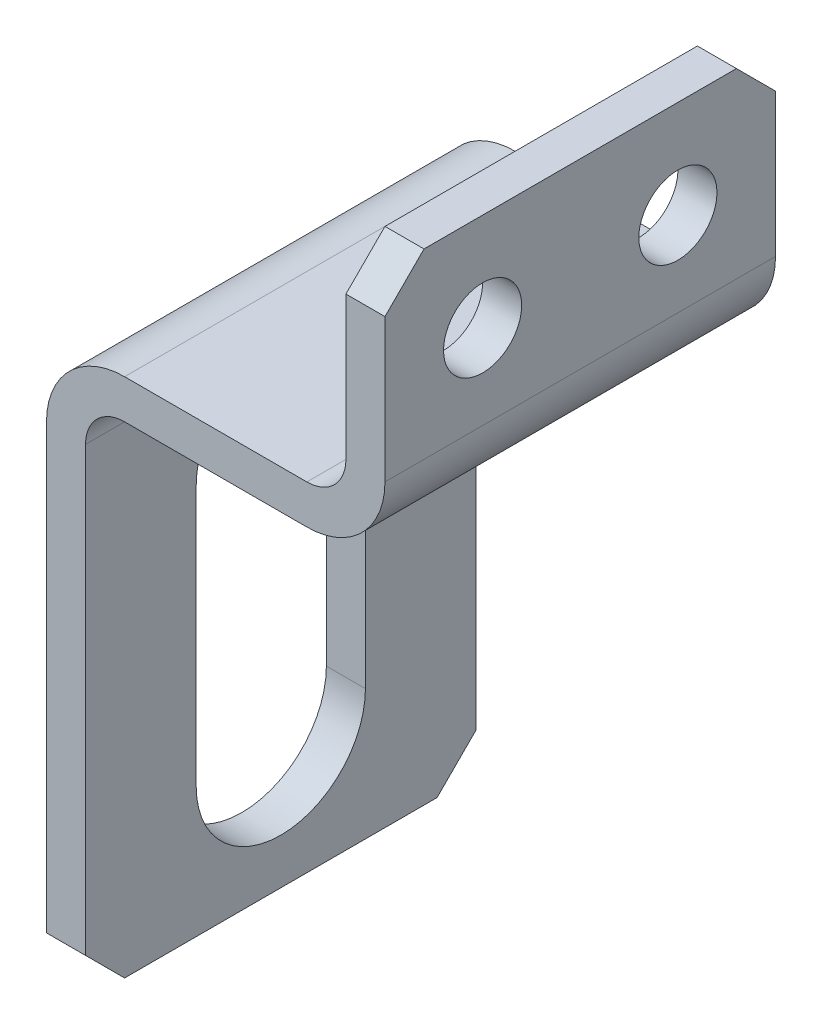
ISO-10303-21;
HEADER;
FILE_DESCRIPTION(('STEP AP214'),'2;1');
FILE_NAME('part.step','',(''),(''),'','','');
FILE_SCHEMA(('AUTOMOTIVE_DESIGN { 1 0 10303 214 1 1 1 1 }'));
ENDSEC;
DATA;
#1=APPLICATION_CONTEXT('core data for automotive mechanical design processes');
#2=APPLICATION_PROTOCOL_DEFINITION('international standard','automotive_design',2000,#1);
#3=PRODUCT_CONTEXT('',#1,'mechanical');
#4=PRODUCT('Part','Part','',(#3));
#5=PRODUCT_RELATED_PRODUCT_CATEGORY('part','',(#4));
#6=PRODUCT_DEFINITION_FORMATION('','',#4);
#7=PRODUCT_DEFINITION_CONTEXT('part definition',#1,'design');
#8=PRODUCT_DEFINITION('design','',#6,#7);
#9=PRODUCT_DEFINITION_SHAPE('','',#8);
#10=(LENGTH_UNIT() NAMED_UNIT(*) SI_UNIT(.MILLI.,.METRE.));
#11=(NAMED_UNIT(*) PLANE_ANGLE_UNIT() SI_UNIT($,.RADIAN.));
#12=(NAMED_UNIT(*) SI_UNIT($,.STERADIAN.) SOLID_ANGLE_UNIT());
#13=UNCERTAINTY_MEASURE_WITH_UNIT(LENGTH_MEASURE(1.E-05),#10,'distance_accuracy_value','');
#14=(GEOMETRIC_REPRESENTATION_CONTEXT(3) GLOBAL_UNCERTAINTY_ASSIGNED_CONTEXT((#13)) GLOBAL_UNIT_ASSIGNED_CONTEXT((#10,
#11,#12)) REPRESENTATION_CONTEXT('',''));
#15=CARTESIAN_POINT('',(0.,0.,0.));
#16=DIRECTION('',(0.,0.,1.));
#17=DIRECTION('',(1.,0.,0.));
#18=AXIS2_PLACEMENT_3D('',#15,#16,#17);
#19=CARTESIAN_POINT('',(-3.,0.,15.));
#20=DIRECTION('',(0.,1.,0.));
#21=DIRECTION('',(0.,0.,1.));
#22=AXIS2_PLACEMENT_3D('',#19,#20,#21);
#23=PLANE('',#22);
#24=DIRECTION('',(0.,0.,-1.));
#25=VECTOR('',#24,1.);
#26=CARTESIAN_POINT('',(-3.,0.,15.));
#27=LINE('',#26,#25);
#28=CARTESIAN_POINT('',(-3.0000000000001,0.,12.));
#29=VERTEX_POINT('',#28);
#30=CARTESIAN_POINT('',(-2.99999999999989,0.,-12.));
#31=VERTEX_POINT('',#30);
#32=EDGE_CURVE('E242',#29,#31,#27,.T.);
#33=ORIENTED_EDGE('',*,*,#32,.T.);
#34=DIRECTION('',(1.,0.,0.));
#35=VECTOR('',#34,1.);
#36=CARTESIAN_POINT('',(-2.99999999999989,0.,-12.));
#37=LINE('',#36,#35);
#38=CARTESIAN_POINT('',(1.11022302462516E-13,0.,-12.));
#39=VERTEX_POINT('',#38);
#40=EDGE_CURVE('E280',#31,#39,#37,.T.);
#41=ORIENTED_EDGE('',*,*,#40,.T.);
#42=DIRECTION('',(0.,0.,-1.));
#43=VECTOR('',#42,1.);
#44=CARTESIAN_POINT('',(0.,0.,15.));
#45=LINE('',#44,#43);
#46=CARTESIAN_POINT('',(-1.11022302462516E-13,0.,12.));
#47=VERTEX_POINT('',#46);
#48=EDGE_CURVE('E275',#47,#39,#45,.T.);
#49=ORIENTED_EDGE('',*,*,#48,.F.);
#50=DIRECTION('',(-1.,0.,0.));
#51=VECTOR('',#50,1.);
#52=CARTESIAN_POINT('',(-3.0000000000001,0.,12.));
#53=LINE('',#52,#51);
#54=EDGE_CURVE('E278',#47,#29,#53,.T.);
#55=ORIENTED_EDGE('',*,*,#54,.T.);
#56=EDGE_LOOP('',(#33,#41,#49,#55));
#57=FACE_BOUND('',#56,.T.);
#58=ADVANCED_FACE('F17',(#57),#23,.F.);
#59=CARTESIAN_POINT('',(0.,0.,15.));
#60=DIRECTION('',(-1.,0.,0.));
#61=DIRECTION('',(0.,0.,1.));
#62=AXIS2_PLACEMENT_3D('',#59,#60,#61);
#63=PLANE('',#62);
#64=DIRECTION('',(0.,-1.,0.));
#65=VECTOR('',#64,1.);
#66=CARTESIAN_POINT('',(1.11022302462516E-13,0.,-6.5));
#67=LINE('',#66,#65);
#68=CARTESIAN_POINT('',(0.,30.,-6.5));
#69=VERTEX_POINT('',#68);
#70=CARTESIAN_POINT('',(0.,10.,-6.5));
#71=VERTEX_POINT('',#70);
#72=EDGE_CURVE('E193',#69,#71,#67,.T.);
#73=ORIENTED_EDGE('',*,*,#72,.T.);
#74=CARTESIAN_POINT('',(0.,10.,0.));
#75=DIRECTION('',(-1.,0.,0.));
#76=DIRECTION('',(0.,0.,1.));
#77=AXIS2_PLACEMENT_3D('',#74,#75,#76);
#78=CIRCLE('',#77,6.5);
#79=CARTESIAN_POINT('',(0.,10.,6.5));
#80=VERTEX_POINT('',#79);
#81=EDGE_CURVE('E196',#71,#80,#78,.T.);
#82=ORIENTED_EDGE('',*,*,#81,.T.);
#83=DIRECTION('',(0.,1.,0.));
#84=VECTOR('',#83,1.);
#85=CARTESIAN_POINT('',(-1.11022302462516E-13,0.,6.5));
#86=LINE('',#85,#84);
#87=CARTESIAN_POINT('',(-1.11022302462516E-13,30.,6.5));
#88=VERTEX_POINT('',#87);
#89=EDGE_CURVE('E188',#80,#88,#86,.T.);
#90=ORIENTED_EDGE('',*,*,#89,.T.);
#91=CARTESIAN_POINT('',(-1.11022302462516E-13,30.,0.));
#92=DIRECTION('',(-1.,0.,0.));
#93=DIRECTION('',(0.,0.,1.));
#94=AXIS2_PLACEMENT_3D('',#91,#92,#93);
#95=CIRCLE('',#94,6.5);
#96=EDGE_CURVE('E163',#88,#69,#95,.T.);
#97=ORIENTED_EDGE('',*,*,#96,.T.);
#98=EDGE_LOOP('',(#73,#82,#90,#97));
#99=FACE_BOUND('',#98,.T.);
#100=ORIENTED_EDGE('',*,*,#48,.T.);
#101=DIRECTION('',(0.,-0.707106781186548,0.707106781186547));
#102=VECTOR('',#101,1.);
#103=CARTESIAN_POINT('',(1.11022302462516E-13,0.,-12.));
#104=LINE('',#103,#102);
#105=CARTESIAN_POINT('',(0.,3.,-15.));
#106=VERTEX_POINT('',#105);
#107=EDGE_CURVE('E285',#39,#106,#104,.F.);
#108=ORIENTED_EDGE('',*,*,#107,.T.);
#109=DIRECTION('',(0.,1.,0.));
#110=VECTOR('',#109,1.);
#111=CARTESIAN_POINT('',(0.,0.,-15.));
#112=LINE('',#111,#110);
#113=CARTESIAN_POINT('',(-1.11022302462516E-13,37.,-15.));
#114=VERTEX_POINT('',#113);
#115=EDGE_CURVE('E199',#106,#114,#112,.T.);
#116=ORIENTED_EDGE('',*,*,#115,.T.);
#117=DIRECTION('',(0.,0.,-1.));
#118=VECTOR('',#117,1.);
#119=CARTESIAN_POINT('',(-1.11022302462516E-13,37.,15.));
#120=LINE('',#119,#118);
#121=CARTESIAN_POINT('',(-1.11022302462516E-13,37.,15.));
#122=VERTEX_POINT('',#121);
#123=EDGE_CURVE('E272',#122,#114,#120,.T.);
#124=ORIENTED_EDGE('',*,*,#123,.F.);
#125=DIRECTION('',(0.,1.,0.));
#126=VECTOR('',#125,1.);
#127=CARTESIAN_POINT('',(0.,0.,15.));
#128=LINE('',#127,#126);
#129=CARTESIAN_POINT('',(0.,3.,15.));
#130=VERTEX_POINT('',#129);
#131=EDGE_CURVE('E221',#130,#122,#128,.T.);
#132=ORIENTED_EDGE('',*,*,#131,.F.);
#133=DIRECTION('',(0.,-0.707106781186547,-0.707106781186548));
#134=VECTOR('',#133,1.);
#135=CARTESIAN_POINT('',(0.,3.,15.));
#136=LINE('',#135,#134);
#137=EDGE_CURVE('E283',#130,#47,#136,.T.);
#138=ORIENTED_EDGE('',*,*,#137,.T.);
#139=EDGE_LOOP('',(#100,#108,#116,#124,#132,#138));
#140=FACE_BOUND('',#139,.T.);
#141=ADVANCED_FACE('F315',(#99,#140),#63,.F.);
#142=CARTESIAN_POINT('',(3.00000000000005,37.,15.));
#143=DIRECTION('',(0.,0.,-1.));
#144=DIRECTION('',(-1.,0.,0.));
#145=AXIS2_PLACEMENT_3D('',#142,#143,#144);
#146=CYLINDRICAL_SURFACE('',#145,3.);
#147=CARTESIAN_POINT('',(3.0000000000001,37.,-15.));
#148=DIRECTION('',(0.,0.,-1.));
#149=DIRECTION('',(1.,0.,0.));
#150=AXIS2_PLACEMENT_3D('',#147,#148,#149);
#151=CIRCLE('',#150,3.);
#152=CARTESIAN_POINT('',(3.0000000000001,40.,-15.));
#153=VERTEX_POINT('',#152);
#154=EDGE_CURVE('E201',#114,#153,#151,.T.);
#155=ORIENTED_EDGE('',*,*,#154,.T.);
#156=DIRECTION('',(0.,0.,-1.));
#157=VECTOR('',#156,1.);
#158=CARTESIAN_POINT('',(3.00000000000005,40.,15.));
#159=LINE('',#158,#157);
#160=CARTESIAN_POINT('',(3.00000000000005,40.,15.));
#161=VERTEX_POINT('',#160);
#162=EDGE_CURVE('E269',#161,#153,#159,.T.);
#163=ORIENTED_EDGE('',*,*,#162,.F.);
#164=CARTESIAN_POINT('',(3.00000000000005,37.,15.));
#165=DIRECTION('',(0.,0.,-1.));
#166=DIRECTION('',(1.,0.,0.));
#167=AXIS2_PLACEMENT_3D('',#164,#165,#166);
#168=CIRCLE('',#167,3.);
#169=EDGE_CURVE('E223',#122,#161,#168,.T.);
#170=ORIENTED_EDGE('',*,*,#169,.F.);
#171=ORIENTED_EDGE('',*,*,#123,.T.);
#172=EDGE_LOOP('',(#155,#163,#170,#171));
#173=FACE_BOUND('',#172,.T.);
#174=ADVANCED_FACE('F322',(#173),#146,.F.);
#175=CARTESIAN_POINT('',(3.00000000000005,40.,15.));
#176=DIRECTION('',(0.,1.,0.));
#177=DIRECTION('',(0.,0.,1.));
#178=AXIS2_PLACEMENT_3D('',#175,#176,#177);
#179=PLANE('',#178);
#180=DIRECTION('',(1.,0.,0.));
#181=VECTOR('',#180,1.);
#182=CARTESIAN_POINT('',(3.0000000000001,40.,-15.));
#183=LINE('',#182,#181);
#184=CARTESIAN_POINT('',(17.,40.,-15.));
#185=VERTEX_POINT('',#184);
#186=EDGE_CURVE('E203',#153,#185,#183,.T.);
#187=ORIENTED_EDGE('',*,*,#186,.T.);
#188=DIRECTION('',(0.,0.,-1.));
#189=VECTOR('',#188,1.);
#190=CARTESIAN_POINT('',(17.,40.,15.));
#191=LINE('',#190,#189);
#192=CARTESIAN_POINT('',(17.,40.,15.));
#193=VERTEX_POINT('',#192);
#194=EDGE_CURVE('E266',#193,#185,#191,.T.);
#195=ORIENTED_EDGE('',*,*,#194,.F.);
#196=DIRECTION('',(1.,0.,0.));
#197=VECTOR('',#196,1.);
#198=CARTESIAN_POINT('',(3.00000000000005,40.,15.));
#199=LINE('',#198,#197);
#200=EDGE_CURVE('E225',#161,#193,#199,.T.);
#201=ORIENTED_EDGE('',*,*,#200,.F.);
#202=ORIENTED_EDGE('',*,*,#162,.T.);
#203=EDGE_LOOP('',(#187,#195,#201,#202));
#204=FACE_BOUND('',#203,.T.);
#205=ADVANCED_FACE('F328',(#204),#179,.F.);
#206=CARTESIAN_POINT('',(17.,46.,15.));
#207=DIRECTION('',(0.,0.,-1.));
#208=DIRECTION('',(-1.,0.,0.));
#209=AXIS2_PLACEMENT_3D('',#206,#207,#208);
#210=CYLINDRICAL_SURFACE('',#209,6.);
#211=CARTESIAN_POINT('',(17.,46.,-15.));
#212=DIRECTION('',(0.,0.,1.));
#213=DIRECTION('',(-1.,0.,0.));
#214=AXIS2_PLACEMENT_3D('',#211,#212,#213);
#215=CIRCLE('',#214,6.);
#216=CARTESIAN_POINT('',(23.,46.,-15.));
#217=VERTEX_POINT('',#216);
#218=EDGE_CURVE('E205',#185,#217,#215,.T.);
#219=ORIENTED_EDGE('',*,*,#218,.T.);
#220=DIRECTION('',(0.,0.,-1.));
#221=VECTOR('',#220,1.);
#222=CARTESIAN_POINT('',(23.,46.,15.));
#223=LINE('',#222,#221);
#224=CARTESIAN_POINT('',(23.,46.,15.));
#225=VERTEX_POINT('',#224);
#226=EDGE_CURVE('E263',#225,#217,#223,.T.);
#227=ORIENTED_EDGE('',*,*,#226,.F.);
#228=CARTESIAN_POINT('',(17.,46.,15.));
#229=DIRECTION('',(0.,0.,1.));
#230=DIRECTION('',(-1.,0.,0.));
#231=AXIS2_PLACEMENT_3D('',#228,#229,#230);
#232=CIRCLE('',#231,6.);
#233=EDGE_CURVE('E227',#193,#225,#232,.T.);
#234=ORIENTED_EDGE('',*,*,#233,.F.);
#235=ORIENTED_EDGE('',*,*,#194,.T.);
#236=EDGE_LOOP('',(#219,#227,#234,#235));
#237=FACE_BOUND('',#236,.T.);
#238=ADVANCED_FACE('F332',(#237),#210,.T.);
#239=CARTESIAN_POINT('',(23.,46.,15.));
#240=DIRECTION('',(-1.,0.,0.));
#241=DIRECTION('',(0.,0.,1.));
#242=AXIS2_PLACEMENT_3D('',#239,#240,#241);
#243=PLANE('',#242);
#244=CARTESIAN_POINT('',(23.,52.5,7.5));
#245=DIRECTION('',(-1.,0.,0.));
#246=DIRECTION('',(0.,0.,1.));
#247=AXIS2_PLACEMENT_3D('',#244,#245,#246);
#248=CIRCLE('',#247,3.);
#249=CARTESIAN_POINT('',(23.,52.5,10.5));
#250=VERTEX_POINT('',#249);
#251=EDGE_CURVE('E450',#250,#250,#248,.T.);
#252=ORIENTED_EDGE('',*,*,#251,.T.);
#253=EDGE_LOOP('',(#252));
#254=FACE_BOUND('',#253,.T.);
#255=CARTESIAN_POINT('',(23.,52.5,-7.49999999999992));
#256=DIRECTION('',(-1.,0.,0.));
#257=DIRECTION('',(0.,0.,1.));
#258=AXIS2_PLACEMENT_3D('',#255,#256,#257);
#259=CIRCLE('',#258,3.);
#260=CARTESIAN_POINT('',(23.,52.5,-4.49999999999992));
#261=VERTEX_POINT('',#260);
#262=EDGE_CURVE('E445',#261,#261,#259,.T.);
#263=ORIENTED_EDGE('',*,*,#262,.T.);
#264=EDGE_LOOP('',(#263));
#265=FACE_BOUND('',#264,.T.);
#266=DIRECTION('',(0.,1.,0.));
#267=VECTOR('',#266,1.);
#268=CARTESIAN_POINT('',(23.,46.,-15.));
#269=LINE('',#268,#267);
#270=CARTESIAN_POINT('',(23.,57.,-15.));
#271=VERTEX_POINT('',#270);
#272=EDGE_CURVE('E207',#217,#271,#269,.T.);
#273=ORIENTED_EDGE('',*,*,#272,.T.);
#274=DIRECTION('',(0.,-0.707106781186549,-0.707106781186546));
#275=VECTOR('',#274,1.);
#276=CARTESIAN_POINT('',(23.,60.,-12.));
#277=LINE('',#276,#275);
#278=CARTESIAN_POINT('',(23.,60.,-12.));
#279=VERTEX_POINT('',#278);
#280=EDGE_CURVE('E304',#271,#279,#277,.F.);
#281=ORIENTED_EDGE('',*,*,#280,.T.);
#282=DIRECTION('',(0.,0.,-1.));
#283=VECTOR('',#282,1.);
#284=CARTESIAN_POINT('',(23.,60.,15.));
#285=LINE('',#284,#283);
#286=CARTESIAN_POINT('',(23.,60.,12.));
#287=VERTEX_POINT('',#286);
#288=EDGE_CURVE('E260',#287,#279,#285,.T.);
#289=ORIENTED_EDGE('',*,*,#288,.F.);
#290=DIRECTION('',(0.,-0.707106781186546,0.70710678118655));
#291=VECTOR('',#290,1.);
#292=CARTESIAN_POINT('',(23.,57.,15.));
#293=LINE('',#292,#291);
#294=CARTESIAN_POINT('',(23.,57.,15.));
#295=VERTEX_POINT('',#294);
#296=EDGE_CURVE('E31',#287,#295,#293,.T.);
#297=ORIENTED_EDGE('',*,*,#296,.T.);
#298=DIRECTION('',(0.,1.,0.));
#299=VECTOR('',#298,1.);
#300=CARTESIAN_POINT('',(23.,46.,15.));
#301=LINE('',#300,#299);
#302=EDGE_CURVE('E229',#225,#295,#301,.T.);
#303=ORIENTED_EDGE('',*,*,#302,.F.);
#304=ORIENTED_EDGE('',*,*,#226,.T.);
#305=EDGE_LOOP('',(#273,#281,#289,#297,#303,#304));
#306=FACE_BOUND('',#305,.T.);
#307=ADVANCED_FACE('F334',(#254,#265,#306),#243,.F.);
#308=CARTESIAN_POINT('',(20.,60.,15.));
#309=DIRECTION('',(0.,-1.,0.));
#310=DIRECTION('',(0.,0.,-1.));
#311=AXIS2_PLACEMENT_3D('',#308,#309,#310);
#312=PLANE('',#311);
#313=ORIENTED_EDGE('',*,*,#288,.T.);
#314=DIRECTION('',(-1.,0.,0.));
#315=VECTOR('',#314,1.);
#316=CARTESIAN_POINT('',(20.,60.,-12.));
#317=LINE('',#316,#315);
#318=CARTESIAN_POINT('',(20.,60.,-12.));
#319=VERTEX_POINT('',#318);
#320=EDGE_CURVE('E297',#279,#319,#317,.T.);
#321=ORIENTED_EDGE('',*,*,#320,.T.);
#322=DIRECTION('',(0.,0.,-1.));
#323=VECTOR('',#322,1.);
#324=CARTESIAN_POINT('',(20.,60.,15.));
#325=LINE('',#324,#323);
#326=CARTESIAN_POINT('',(20.,60.,12.));
#327=VERTEX_POINT('',#326);
#328=EDGE_CURVE('E257',#327,#319,#325,.T.);
#329=ORIENTED_EDGE('',*,*,#328,.F.);
#330=DIRECTION('',(1.,0.,0.));
#331=VECTOR('',#330,1.);
#332=CARTESIAN_POINT('',(23.,60.,12.));
#333=LINE('',#332,#331);
#334=EDGE_CURVE('E295',#327,#287,#333,.T.);
#335=ORIENTED_EDGE('',*,*,#334,.T.);
#336=EDGE_LOOP('',(#313,#321,#329,#335));
#337=FACE_BOUND('',#336,.T.);
#338=ADVANCED_FACE('F339',(#337),#312,.F.);
#339=CARTESIAN_POINT('',(20.,46.,15.));
#340=DIRECTION('',(1.,0.,0.));
#341=DIRECTION('',(0.,0.,-1.));
#342=AXIS2_PLACEMENT_3D('',#339,#340,#341);
#343=PLANE('',#342);
#344=CARTESIAN_POINT('',(20.,52.5,7.5));
#345=DIRECTION('',(-1.,0.,0.));
#346=DIRECTION('',(0.,0.,1.));
#347=AXIS2_PLACEMENT_3D('',#344,#345,#346);
#348=CIRCLE('',#347,3.);
#349=CARTESIAN_POINT('',(20.,52.5,10.5));
#350=VERTEX_POINT('',#349);
#351=EDGE_CURVE('E454',#350,#350,#348,.T.);
#352=ORIENTED_EDGE('',*,*,#351,.F.);
#353=EDGE_LOOP('',(#352));
#354=FACE_BOUND('',#353,.T.);
#355=CARTESIAN_POINT('',(20.,52.5,-7.49999999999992));
#356=DIRECTION('',(-1.,0.,0.));
#357=DIRECTION('',(0.,0.,1.));
#358=AXIS2_PLACEMENT_3D('',#355,#356,#357);
#359=CIRCLE('',#358,3.);
#360=CARTESIAN_POINT('',(20.,52.5,-4.49999999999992));
#361=VERTEX_POINT('',#360);
#362=EDGE_CURVE('E448',#361,#361,#359,.T.);
#363=ORIENTED_EDGE('',*,*,#362,.F.);
#364=EDGE_LOOP('',(#363));
#365=FACE_BOUND('',#364,.T.);
#366=ORIENTED_EDGE('',*,*,#328,.T.);
#367=DIRECTION('',(0.,0.707106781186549,0.707106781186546));
#368=VECTOR('',#367,1.);
#369=CARTESIAN_POINT('',(20.,60.,-12.));
#370=LINE('',#369,#368);
#371=CARTESIAN_POINT('',(20.,57.,-15.));
#372=VERTEX_POINT('',#371);
#373=EDGE_CURVE('E301',#319,#372,#370,.F.);
#374=ORIENTED_EDGE('',*,*,#373,.T.);
#375=DIRECTION('',(0.,-1.,0.));
#376=VECTOR('',#375,1.);
#377=CARTESIAN_POINT('',(20.,46.,-15.));
#378=LINE('',#377,#376);
#379=CARTESIAN_POINT('',(20.,46.,-15.));
#380=VERTEX_POINT('',#379);
#381=EDGE_CURVE('E210',#372,#380,#378,.T.);
#382=ORIENTED_EDGE('',*,*,#381,.T.);
#383=DIRECTION('',(0.,0.,-1.));
#384=VECTOR('',#383,1.);
#385=CARTESIAN_POINT('',(20.,46.,15.));
#386=LINE('',#385,#384);
#387=CARTESIAN_POINT('',(20.,46.,15.));
#388=VERTEX_POINT('',#387);
#389=EDGE_CURVE('E254',#388,#380,#386,.T.);
#390=ORIENTED_EDGE('',*,*,#389,.F.);
#391=DIRECTION('',(0.,-1.,0.));
#392=VECTOR('',#391,1.);
#393=CARTESIAN_POINT('',(20.,46.,15.));
#394=LINE('',#393,#392);
#395=CARTESIAN_POINT('',(20.,57.,15.));
#396=VERTEX_POINT('',#395);
#397=EDGE_CURVE('E231',#396,#388,#394,.T.);
#398=ORIENTED_EDGE('',*,*,#397,.F.);
#399=DIRECTION('',(0.,0.707106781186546,-0.70710678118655));
#400=VECTOR('',#399,1.);
#401=CARTESIAN_POINT('',(20.,57.,15.));
#402=LINE('',#401,#400);
#403=EDGE_CURVE('E39',#396,#327,#402,.T.);
#404=ORIENTED_EDGE('',*,*,#403,.T.);
#405=EDGE_LOOP('',(#366,#374,#382,#390,#398,#404));
#406=FACE_BOUND('',#405,.T.);
#407=ADVANCED_FACE('F346',(#354,#365,#406),#343,.F.);
#408=CARTESIAN_POINT('',(17.,46.,15.));
#409=DIRECTION('',(0.,0.,-1.));
#410=DIRECTION('',(-1.,0.,0.));
#411=AXIS2_PLACEMENT_3D('',#408,#409,#410);
#412=CYLINDRICAL_SURFACE('',#411,3.);
#413=CARTESIAN_POINT('',(17.,46.,-15.));
#414=DIRECTION('',(0.,0.,-1.));
#415=DIRECTION('',(-1.,0.,0.));
#416=AXIS2_PLACEMENT_3D('',#413,#414,#415);
#417=CIRCLE('',#416,3.);
#418=CARTESIAN_POINT('',(17.,43.,-15.));
#419=VERTEX_POINT('',#418);
#420=EDGE_CURVE('E212',#380,#419,#417,.T.);
#421=ORIENTED_EDGE('',*,*,#420,.T.);
#422=DIRECTION('',(0.,0.,-1.));
#423=VECTOR('',#422,1.);
#424=CARTESIAN_POINT('',(17.,43.,15.));
#425=LINE('',#424,#423);
#426=CARTESIAN_POINT('',(17.,43.,15.));
#427=VERTEX_POINT('',#426);
#428=EDGE_CURVE('E251',#427,#419,#425,.T.);
#429=ORIENTED_EDGE('',*,*,#428,.F.);
#430=CARTESIAN_POINT('',(17.,46.,15.));
#431=DIRECTION('',(0.,0.,-1.));
#432=DIRECTION('',(-1.,0.,0.));
#433=AXIS2_PLACEMENT_3D('',#430,#431,#432);
#434=CIRCLE('',#433,3.);
#435=EDGE_CURVE('E233',#388,#427,#434,.T.);
#436=ORIENTED_EDGE('',*,*,#435,.F.);
#437=ORIENTED_EDGE('',*,*,#389,.T.);
#438=EDGE_LOOP('',(#421,#429,#436,#437));
#439=FACE_BOUND('',#438,.T.);
#440=ADVANCED_FACE('F354',(#439),#412,.F.);
#441=CARTESIAN_POINT('',(3.00000000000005,43.,15.));
#442=DIRECTION('',(0.,-1.,0.));
#443=DIRECTION('',(1.,0.,0.));
#444=AXIS2_PLACEMENT_3D('',#441,#442,#443);
#445=PLANE('',#444);
#446=DIRECTION('',(-1.,0.,0.));
#447=VECTOR('',#446,1.);
#448=CARTESIAN_POINT('',(3.00000000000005,43.,-15.));
#449=LINE('',#448,#447);
#450=CARTESIAN_POINT('',(3.00000000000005,43.,-15.));
#451=VERTEX_POINT('',#450);
#452=EDGE_CURVE('E214',#419,#451,#449,.T.);
#453=ORIENTED_EDGE('',*,*,#452,.T.);
#454=DIRECTION('',(0.,0.,-1.));
#455=VECTOR('',#454,1.);
#456=CARTESIAN_POINT('',(3.00000000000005,43.,15.));
#457=LINE('',#456,#455);
#458=CARTESIAN_POINT('',(3.00000000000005,43.,15.));
#459=VERTEX_POINT('',#458);
#460=EDGE_CURVE('E248',#459,#451,#457,.T.);
#461=ORIENTED_EDGE('',*,*,#460,.F.);
#462=DIRECTION('',(-1.,0.,0.));
#463=VECTOR('',#462,1.);
#464=CARTESIAN_POINT('',(3.00000000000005,43.,15.));
#465=LINE('',#464,#463);
#466=EDGE_CURVE('E235',#427,#459,#465,.T.);
#467=ORIENTED_EDGE('',*,*,#466,.F.);
#468=ORIENTED_EDGE('',*,*,#428,.T.);
#469=EDGE_LOOP('',(#453,#461,#467,#468));
#470=FACE_BOUND('',#469,.T.);
#471=ADVANCED_FACE('F358',(#470),#445,.F.);
#472=CARTESIAN_POINT('',(3.00000000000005,37.,15.));
#473=DIRECTION('',(0.,0.,-1.));
#474=DIRECTION('',(-1.,0.,0.));
#475=AXIS2_PLACEMENT_3D('',#472,#473,#474);
#476=CYLINDRICAL_SURFACE('',#475,6.);
#477=CARTESIAN_POINT('',(3.0000000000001,37.,-15.));
#478=DIRECTION('',(0.,0.,1.));
#479=DIRECTION('',(1.,0.,0.));
#480=AXIS2_PLACEMENT_3D('',#477,#478,#479);
#481=CIRCLE('',#480,6.);
#482=CARTESIAN_POINT('',(-3.00000000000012,37.,-15.));
#483=VERTEX_POINT('',#482);
#484=EDGE_CURVE('E216',#451,#483,#481,.T.);
#485=ORIENTED_EDGE('',*,*,#484,.T.);
#486=DIRECTION('',(0.,0.,-1.));
#487=VECTOR('',#486,1.);
#488=CARTESIAN_POINT('',(-3.00000000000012,37.,15.));
#489=LINE('',#488,#487);
#490=CARTESIAN_POINT('',(-3.00000000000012,37.,15.));
#491=VERTEX_POINT('',#490);
#492=EDGE_CURVE('E245',#491,#483,#489,.T.);
#493=ORIENTED_EDGE('',*,*,#492,.F.);
#494=CARTESIAN_POINT('',(3.00000000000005,37.,15.));
#495=DIRECTION('',(0.,0.,1.));
#496=DIRECTION('',(1.,0.,0.));
#497=AXIS2_PLACEMENT_3D('',#494,#495,#496);
#498=CIRCLE('',#497,6.);
#499=EDGE_CURVE('E237',#459,#491,#498,.T.);
#500=ORIENTED_EDGE('',*,*,#499,.F.);
#501=ORIENTED_EDGE('',*,*,#460,.T.);
#502=EDGE_LOOP('',(#485,#493,#500,#501));
#503=FACE_BOUND('',#502,.T.);
#504=ADVANCED_FACE('F363',(#503),#476,.T.);
#505=CARTESIAN_POINT('',(-3.,0.,15.));
#506=DIRECTION('',(1.,0.,0.));
#507=DIRECTION('',(0.,0.,-1.));
#508=AXIS2_PLACEMENT_3D('',#505,#506,#507);
#509=PLANE('',#508);
#510=DIRECTION('',(0.,1.,0.));
#511=VECTOR('',#510,1.);
#512=CARTESIAN_POINT('',(-3.0000000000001,30.,6.5));
#513=LINE('',#512,#511);
#514=CARTESIAN_POINT('',(-3.00000000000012,10.,6.5));
#515=VERTEX_POINT('',#514);
#516=CARTESIAN_POINT('',(-3.0000000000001,30.,6.5));
#517=VERTEX_POINT('',#516);
#518=EDGE_CURVE('E171',#515,#517,#513,.T.);
#519=ORIENTED_EDGE('',*,*,#518,.F.);
#520=CARTESIAN_POINT('',(-3.,10.,0.));
#521=DIRECTION('',(-1.,0.,0.));
#522=DIRECTION('',(0.,0.,1.));
#523=AXIS2_PLACEMENT_3D('',#520,#521,#522);
#524=CIRCLE('',#523,6.5);
#525=CARTESIAN_POINT('',(-3.,10.,-6.5));
#526=VERTEX_POINT('',#525);
#527=EDGE_CURVE('E176',#526,#515,#524,.T.);
#528=ORIENTED_EDGE('',*,*,#527,.F.);
#529=DIRECTION('',(0.,-1.,0.));
#530=VECTOR('',#529,1.);
#531=CARTESIAN_POINT('',(-3.,30.,-6.5));
#532=LINE('',#531,#530);
#533=CARTESIAN_POINT('',(-3.,30.,-6.5));
#534=VERTEX_POINT('',#533);
#535=EDGE_CURVE('E181',#534,#526,#532,.T.);
#536=ORIENTED_EDGE('',*,*,#535,.F.);
#537=CARTESIAN_POINT('',(-3.00000000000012,30.,0.));
#538=DIRECTION('',(-1.,0.,0.));
#539=DIRECTION('',(0.,0.,1.));
#540=AXIS2_PLACEMENT_3D('',#537,#538,#539);
#541=CIRCLE('',#540,6.5);
#542=EDGE_CURVE('E160',#517,#534,#541,.T.);
#543=ORIENTED_EDGE('',*,*,#542,.F.);
#544=EDGE_LOOP('',(#519,#528,#536,#543));
#545=FACE_BOUND('',#544,.T.);
#546=DIRECTION('',(0.,-1.,0.));
#547=VECTOR('',#546,1.);
#548=CARTESIAN_POINT('',(-3.,0.,-15.));
#549=LINE('',#548,#547);
#550=CARTESIAN_POINT('',(-3.,3.,-15.));
#551=VERTEX_POINT('',#550);
#552=EDGE_CURVE('E218',#483,#551,#549,.T.);
#553=ORIENTED_EDGE('',*,*,#552,.T.);
#554=DIRECTION('',(0.,0.707106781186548,-0.707106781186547));
#555=VECTOR('',#554,1.);
#556=CARTESIAN_POINT('',(-2.99999999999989,0.,-12.));
#557=LINE('',#556,#555);
#558=EDGE_CURVE('E293',#551,#31,#557,.F.);
#559=ORIENTED_EDGE('',*,*,#558,.T.);
#560=ORIENTED_EDGE('',*,*,#32,.F.);
#561=DIRECTION('',(0.,0.707106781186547,0.707106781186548));
#562=VECTOR('',#561,1.);
#563=CARTESIAN_POINT('',(-3.,3.,15.));
#564=LINE('',#563,#562);
#565=CARTESIAN_POINT('',(-3.,3.,15.));
#566=VERTEX_POINT('',#565);
#567=EDGE_CURVE('E291',#29,#566,#564,.T.);
#568=ORIENTED_EDGE('',*,*,#567,.T.);
#569=DIRECTION('',(0.,-1.,0.));
#570=VECTOR('',#569,1.);
#571=CARTESIAN_POINT('',(-3.,0.,15.));
#572=LINE('',#571,#570);
#573=EDGE_CURVE('E239',#491,#566,#572,.T.);
#574=ORIENTED_EDGE('',*,*,#573,.F.);
#575=ORIENTED_EDGE('',*,*,#492,.T.);
#576=EDGE_LOOP('',(#553,#559,#560,#568,#574,#575));
#577=FACE_BOUND('',#576,.T.);
#578=ADVANCED_FACE('F178',(#545,#577),#509,.F.);
#579=CARTESIAN_POINT('',(3.00000000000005,37.,15.));
#580=DIRECTION('',(0.,0.,1.));
#581=DIRECTION('',(1.,0.,0.));
#582=AXIS2_PLACEMENT_3D('',#579,#580,#581);
#583=PLANE('',#582);
#584=ORIENTED_EDGE('',*,*,#302,.T.);
#585=DIRECTION('',(-1.,0.,0.));
#586=VECTOR('',#585,1.);
#587=CARTESIAN_POINT('',(20.,57.,15.));
#588=LINE('',#587,#586);
#589=EDGE_CURVE('E11',#295,#396,#588,.T.);
#590=ORIENTED_EDGE('',*,*,#589,.T.);
#591=ORIENTED_EDGE('',*,*,#397,.T.);
#592=ORIENTED_EDGE('',*,*,#435,.T.);
#593=ORIENTED_EDGE('',*,*,#466,.T.);
#594=ORIENTED_EDGE('',*,*,#499,.T.);
#595=ORIENTED_EDGE('',*,*,#573,.T.);
#596=DIRECTION('',(1.,0.,0.));
#597=VECTOR('',#596,1.);
#598=CARTESIAN_POINT('',(0.,3.,15.));
#599=LINE('',#598,#597);
#600=EDGE_CURVE('E24',#566,#130,#599,.T.);
#601=ORIENTED_EDGE('',*,*,#600,.T.);
#602=ORIENTED_EDGE('',*,*,#131,.T.);
#603=ORIENTED_EDGE('',*,*,#169,.T.);
#604=ORIENTED_EDGE('',*,*,#200,.T.);
#605=ORIENTED_EDGE('',*,*,#233,.T.);
#606=EDGE_LOOP('',(#584,#590,#591,#592,#593,#594,#595,#601,#602,#603,#604,#605));
#607=FACE_BOUND('',#606,.T.);
#608=ADVANCED_FACE('F309',(#607),#583,.T.);
#609=CARTESIAN_POINT('',(3.0000000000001,37.,-15.));
#610=DIRECTION('',(0.,0.,1.));
#611=DIRECTION('',(1.,0.,0.));
#612=AXIS2_PLACEMENT_3D('',#609,#610,#611);
#613=PLANE('',#612);
#614=ORIENTED_EDGE('',*,*,#115,.F.);
#615=DIRECTION('',(-1.,0.,0.));
#616=VECTOR('',#615,1.);
#617=CARTESIAN_POINT('',(3.,3.,-15.));
#618=LINE('',#617,#616);
#619=EDGE_CURVE('E289',#106,#551,#618,.T.);
#620=ORIENTED_EDGE('',*,*,#619,.T.);
#621=ORIENTED_EDGE('',*,*,#552,.F.);
#622=ORIENTED_EDGE('',*,*,#484,.F.);
#623=ORIENTED_EDGE('',*,*,#452,.F.);
#624=ORIENTED_EDGE('',*,*,#420,.F.);
#625=ORIENTED_EDGE('',*,*,#381,.F.);
#626=DIRECTION('',(1.,0.,0.));
#627=VECTOR('',#626,1.);
#628=CARTESIAN_POINT('',(3.00000000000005,57.,-15.));
#629=LINE('',#628,#627);
#630=EDGE_CURVE('E287',#372,#271,#629,.T.);
#631=ORIENTED_EDGE('',*,*,#630,.T.);
#632=ORIENTED_EDGE('',*,*,#272,.F.);
#633=ORIENTED_EDGE('',*,*,#218,.F.);
#634=ORIENTED_EDGE('',*,*,#186,.F.);
#635=ORIENTED_EDGE('',*,*,#154,.F.);
#636=EDGE_LOOP('',(#614,#620,#621,#622,#623,#624,#625,#631,#632,#633,#634,#635));
#637=FACE_BOUND('',#636,.T.);
#638=ADVANCED_FACE('F373',(#637),#613,.F.);
#639=CARTESIAN_POINT('',(23.,10.,0.));
#640=DIRECTION('',(-1.,0.,0.));
#641=DIRECTION('',(0.,0.,1.));
#642=AXIS2_PLACEMENT_3D('',#639,#640,#641);
#643=CYLINDRICAL_SURFACE('',#642,6.5);
#644=DIRECTION('',(-1.,0.,0.));
#645=VECTOR('',#644,1.);
#646=CARTESIAN_POINT('',(23.,10.,-6.5));
#647=LINE('',#646,#645);
#648=EDGE_CURVE('E186',#71,#526,#647,.T.);
#649=ORIENTED_EDGE('',*,*,#648,.T.);
#650=ORIENTED_EDGE('',*,*,#527,.T.);
#651=DIRECTION('',(-1.,0.,0.));
#652=VECTOR('',#651,1.);
#653=CARTESIAN_POINT('',(23.,10.,6.5));
#654=LINE('',#653,#652);
#655=EDGE_CURVE('E167',#80,#515,#654,.T.);
#656=ORIENTED_EDGE('',*,*,#655,.F.);
#657=ORIENTED_EDGE('',*,*,#81,.F.);
#658=EDGE_LOOP('',(#649,#650,#656,#657));
#659=FACE_BOUND('',#658,.T.);
#660=ADVANCED_FACE('F425',(#659),#643,.F.);
#661=CARTESIAN_POINT('',(23.,30.,-6.5));
#662=DIRECTION('',(0.,0.,-1.));
#663=DIRECTION('',(0.,1.,0.));
#664=AXIS2_PLACEMENT_3D('',#661,#662,#663);
#665=PLANE('',#664);
#666=DIRECTION('',(-1.,0.,0.));
#667=VECTOR('',#666,1.);
#668=CARTESIAN_POINT('',(23.,30.,-6.5));
#669=LINE('',#668,#667);
#670=EDGE_CURVE('E166',#69,#534,#669,.T.);
#671=ORIENTED_EDGE('',*,*,#670,.T.);
#672=ORIENTED_EDGE('',*,*,#535,.T.);
#673=ORIENTED_EDGE('',*,*,#648,.F.);
#674=ORIENTED_EDGE('',*,*,#72,.F.);
#675=EDGE_LOOP('',(#671,#672,#673,#674));
#676=FACE_BOUND('',#675,.T.);
#677=ADVANCED_FACE('F428',(#676),#665,.F.);
#678=CARTESIAN_POINT('',(23.,30.,0.));
#679=DIRECTION('',(-1.,0.,0.));
#680=DIRECTION('',(0.,0.,1.));
#681=AXIS2_PLACEMENT_3D('',#678,#679,#680);
#682=CYLINDRICAL_SURFACE('',#681,6.5);
#683=DIRECTION('',(-1.,0.,0.));
#684=VECTOR('',#683,1.);
#685=CARTESIAN_POINT('',(23.,30.,6.5));
#686=LINE('',#685,#684);
#687=EDGE_CURVE('E155',#88,#517,#686,.T.);
#688=ORIENTED_EDGE('',*,*,#687,.T.);
#689=ORIENTED_EDGE('',*,*,#542,.T.);
#690=ORIENTED_EDGE('',*,*,#670,.F.);
#691=ORIENTED_EDGE('',*,*,#96,.F.);
#692=EDGE_LOOP('',(#688,#689,#690,#691));
#693=FACE_BOUND('',#692,.T.);
#694=ADVANCED_FACE('F157',(#693),#682,.F.);
#695=CARTESIAN_POINT('',(23.,30.,6.5));
#696=DIRECTION('',(0.,0.,1.));
#697=DIRECTION('',(0.,-1.,0.));
#698=AXIS2_PLACEMENT_3D('',#695,#696,#697);
#699=PLANE('',#698);
#700=ORIENTED_EDGE('',*,*,#655,.T.);
#701=ORIENTED_EDGE('',*,*,#518,.T.);
#702=ORIENTED_EDGE('',*,*,#687,.F.);
#703=ORIENTED_EDGE('',*,*,#89,.F.);
#704=EDGE_LOOP('',(#700,#701,#702,#703));
#705=FACE_BOUND('',#704,.T.);
#706=ADVANCED_FACE('F172',(#705),#699,.F.);
#707=CARTESIAN_POINT('',(23.,52.5,-7.49999999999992));
#708=DIRECTION('',(-1.,0.,0.));
#709=DIRECTION('',(0.,0.,1.));
#710=AXIS2_PLACEMENT_3D('',#707,#708,#709);
#711=CYLINDRICAL_SURFACE('',#710,3.);
#712=ORIENTED_EDGE('',*,*,#262,.F.);
#713=EDGE_LOOP('',(#712));
#714=FACE_BOUND('',#713,.T.);
#715=ORIENTED_EDGE('',*,*,#362,.T.);
#716=EDGE_LOOP('',(#715));
#717=FACE_BOUND('',#716,.T.);
#718=ADVANCED_FACE('F386',(#714,#717),#711,.F.);
#719=CARTESIAN_POINT('',(23.,52.5,7.5));
#720=DIRECTION('',(-1.,0.,0.));
#721=DIRECTION('',(0.,0.,1.));
#722=AXIS2_PLACEMENT_3D('',#719,#720,#721);
#723=CYLINDRICAL_SURFACE('',#722,3.);
#724=ORIENTED_EDGE('',*,*,#251,.F.);
#725=EDGE_LOOP('',(#724));
#726=FACE_BOUND('',#725,.T.);
#727=ORIENTED_EDGE('',*,*,#351,.T.);
#728=EDGE_LOOP('',(#727));
#729=FACE_BOUND('',#728,.T.);
#730=ADVANCED_FACE('F377',(#726,#729),#723,.F.);
#731=CARTESIAN_POINT('',(-2.99999999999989,0.,-12.));
#732=DIRECTION('',(0.,0.707106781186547,0.707106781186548));
#733=DIRECTION('',(0.,-0.707106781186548,0.707106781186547));
#734=AXIS2_PLACEMENT_3D('',#731,#732,#733);
#735=PLANE('',#734);
#736=ORIENTED_EDGE('',*,*,#558,.F.);
#737=ORIENTED_EDGE('',*,*,#619,.F.);
#738=ORIENTED_EDGE('',*,*,#107,.F.);
#739=ORIENTED_EDGE('',*,*,#40,.F.);
#740=EDGE_LOOP('',(#736,#737,#738,#739));
#741=FACE_BOUND('',#740,.T.);
#742=ADVANCED_FACE('F375',(#741),#735,.F.);
#743=CARTESIAN_POINT('',(20.,60.,-12.));
#744=DIRECTION('',(0.,-0.707106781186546,0.707106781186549));
#745=DIRECTION('',(0.,-0.707106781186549,-0.707106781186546));
#746=AXIS2_PLACEMENT_3D('',#743,#744,#745);
#747=PLANE('',#746);
#748=ORIENTED_EDGE('',*,*,#280,.F.);
#749=ORIENTED_EDGE('',*,*,#630,.F.);
#750=ORIENTED_EDGE('',*,*,#373,.F.);
#751=ORIENTED_EDGE('',*,*,#320,.F.);
#752=EDGE_LOOP('',(#748,#749,#750,#751));
#753=FACE_BOUND('',#752,.T.);
#754=ADVANCED_FACE('F344',(#753),#747,.F.);
#755=CARTESIAN_POINT('',(3.00000000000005,57.,15.));
#756=DIRECTION('',(0.,0.70710678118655,0.707106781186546));
#757=DIRECTION('',(0.,-0.707106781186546,0.70710678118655));
#758=AXIS2_PLACEMENT_3D('',#755,#756,#757);
#759=PLANE('',#758);
#760=ORIENTED_EDGE('',*,*,#296,.F.);
#761=ORIENTED_EDGE('',*,*,#334,.F.);
#762=ORIENTED_EDGE('',*,*,#403,.F.);
#763=ORIENTED_EDGE('',*,*,#589,.F.);
#764=EDGE_LOOP('',(#760,#761,#762,#763));
#765=FACE_BOUND('',#764,.T.);
#766=ADVANCED_FACE('F336',(#765),#759,.T.);
#767=CARTESIAN_POINT('',(3.,3.,15.));
#768=DIRECTION('',(0.,-0.707106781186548,0.707106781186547));
#769=DIRECTION('',(0.,-0.707106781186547,-0.707106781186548));
#770=AXIS2_PLACEMENT_3D('',#767,#768,#769);
#771=PLANE('',#770);
#772=ORIENTED_EDGE('',*,*,#567,.F.);
#773=ORIENTED_EDGE('',*,*,#54,.F.);
#774=ORIENTED_EDGE('',*,*,#137,.F.);
#775=ORIENTED_EDGE('',*,*,#600,.F.);
#776=EDGE_LOOP('',(#772,#773,#774,#775));
#777=FACE_BOUND('',#776,.T.);
#778=ADVANCED_FACE('F367',(#777),#771,.T.);
#779=CLOSED_SHELL('',(#58,#141,#174,#205,#238,#307,#338,#407,#440,#471,#504,#578,#608,#638,#660,
#677,#694,#706,#718,#730,#742,#754,#766,#778));
#780=MANIFOLD_SOLID_BREP('B1',#779);
#781=ADVANCED_BREP_SHAPE_REPRESENTATION('',(#18,#780),#14);
#782=SHAPE_DEFINITION_REPRESENTATION(#9,#781);
ENDSEC;
END-ISO-10303-21;
